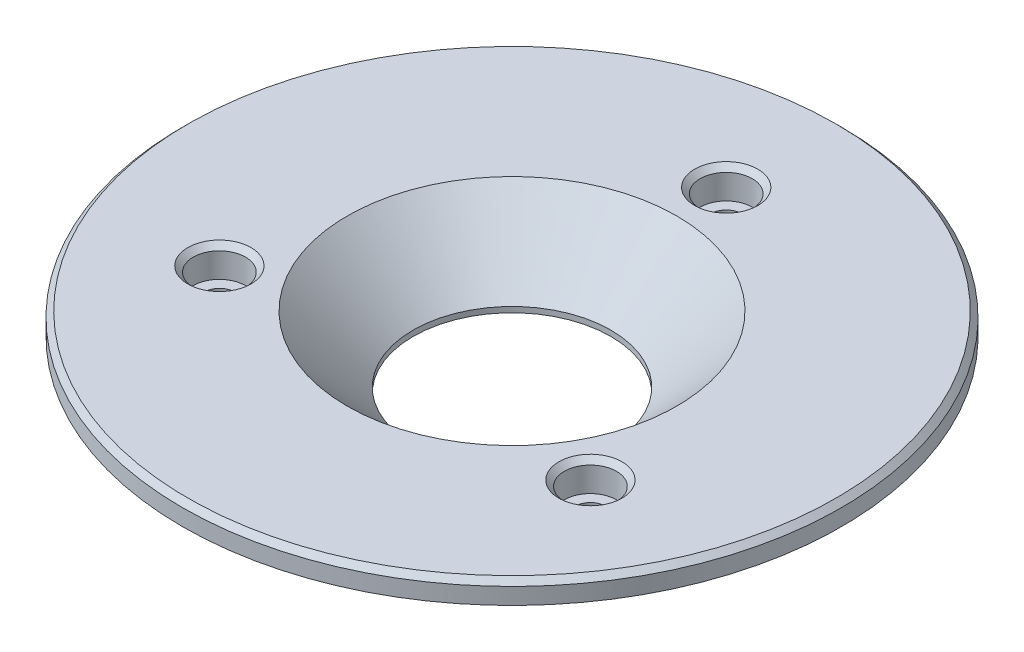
ISO-10303-21;
HEADER;
FILE_DESCRIPTION(('STEP AP214'),'2;1');
FILE_NAME('part.step','',(''),(''),'','','');
FILE_SCHEMA(('AUTOMOTIVE_DESIGN { 1 0 10303 214 1 1 1 1 }'));
ENDSEC;
DATA;
#1=APPLICATION_CONTEXT('core data for automotive mechanical design processes');
#2=APPLICATION_PROTOCOL_DEFINITION('international standard','automotive_design',2000,#1);
#3=PRODUCT_CONTEXT('',#1,'mechanical');
#4=PRODUCT('Part','Part','',(#3));
#5=PRODUCT_RELATED_PRODUCT_CATEGORY('part','',(#4));
#6=PRODUCT_DEFINITION_FORMATION('','',#4);
#7=PRODUCT_DEFINITION_CONTEXT('part definition',#1,'design');
#8=PRODUCT_DEFINITION('design','',#6,#7);
#9=PRODUCT_DEFINITION_SHAPE('','',#8);
#10=(LENGTH_UNIT() NAMED_UNIT(*) SI_UNIT(.MILLI.,.METRE.));
#11=(NAMED_UNIT(*) PLANE_ANGLE_UNIT() SI_UNIT($,.RADIAN.));
#12=(NAMED_UNIT(*) SI_UNIT($,.STERADIAN.) SOLID_ANGLE_UNIT());
#13=UNCERTAINTY_MEASURE_WITH_UNIT(LENGTH_MEASURE(1.E-05),#10,'distance_accuracy_value','');
#14=(GEOMETRIC_REPRESENTATION_CONTEXT(3) GLOBAL_UNCERTAINTY_ASSIGNED_CONTEXT((#13)) GLOBAL_UNIT_ASSIGNED_CONTEXT((#10,
#11,#12)) REPRESENTATION_CONTEXT('',''));
#15=CARTESIAN_POINT('',(0.,0.,0.));
#16=DIRECTION('',(0.,0.,1.));
#17=DIRECTION('',(1.,0.,0.));
#18=AXIS2_PLACEMENT_3D('',#15,#16,#17);
#19=CARTESIAN_POINT('',(-30.,13.,0.));
#20=DIRECTION('',(0.,-1.,0.));
#21=DIRECTION('',(0.,0.,-1.));
#22=AXIS2_PLACEMENT_3D('',#19,#20,#21);
#23=PLANE('',#22);
#24=CARTESIAN_POINT('',(33.7749907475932,13.,19.5));
#25=DIRECTION('',(0.,-1.,0.));
#26=DIRECTION('',(0.,0.,-1.));
#27=AXIS2_PLACEMENT_3D('',#24,#25,#26);
#28=CIRCLE('',#27,5.75);
#29=CARTESIAN_POINT('',(33.7749907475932,13.,13.75));
#30=VERTEX_POINT('',#29);
#31=EDGE_CURVE('E25',#30,#30,#28,.T.);
#32=ORIENTED_EDGE('',*,*,#31,.T.);
#33=EDGE_LOOP('',(#32));
#34=FACE_BOUND('',#33,.T.);
#35=CARTESIAN_POINT('',(0.,13.,-39.));
#36=DIRECTION('',(0.,-1.,0.));
#37=DIRECTION('',(0.,0.,-1.));
#38=AXIS2_PLACEMENT_3D('',#35,#36,#37);
#39=CIRCLE('',#38,5.75);
#40=CARTESIAN_POINT('',(0.,13.,-44.75));
#41=VERTEX_POINT('',#40);
#42=EDGE_CURVE('E29',#41,#41,#39,.T.);
#43=ORIENTED_EDGE('',*,*,#42,.T.);
#44=EDGE_LOOP('',(#43));
#45=FACE_BOUND('',#44,.T.);
#46=CARTESIAN_POINT('',(-33.7749907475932,13.,19.5));
#47=DIRECTION('',(0.,-1.,0.));
#48=DIRECTION('',(0.,0.,-1.));
#49=AXIS2_PLACEMENT_3D('',#46,#47,#48);
#50=CIRCLE('',#49,5.75);
#51=CARTESIAN_POINT('',(-33.7749907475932,13.,13.75));
#52=VERTEX_POINT('',#51);
#53=EDGE_CURVE('E34',#52,#52,#50,.T.);
#54=ORIENTED_EDGE('',*,*,#53,.T.);
#55=EDGE_LOOP('',(#54));
#56=FACE_BOUND('',#55,.T.);
#57=CARTESIAN_POINT('',(0.,13.,0.));
#58=DIRECTION('',(0.,-1.,0.));
#59=DIRECTION('',(0.,0.,-1.));
#60=AXIS2_PLACEMENT_3D('',#57,#58,#59);
#61=CIRCLE('',#60,59.);
#62=CARTESIAN_POINT('',(0.,13.,-59.));
#63=VERTEX_POINT('',#62);
#64=EDGE_CURVE('E58',#63,#63,#61,.F.);
#65=ORIENTED_EDGE('',*,*,#64,.T.);
#66=EDGE_LOOP('',(#65));
#67=FACE_BOUND('',#66,.T.);
#68=CARTESIAN_POINT('',(0.,13.,0.));
#69=DIRECTION('',(0.,-1.,0.));
#70=DIRECTION('',(0.,0.,-1.));
#71=AXIS2_PLACEMENT_3D('',#68,#69,#70);
#72=CIRCLE('',#71,30.);
#73=CARTESIAN_POINT('',(0.,13.,-30.));
#74=VERTEX_POINT('',#73);
#75=EDGE_CURVE('E70',#74,#74,#72,.T.);
#76=ORIENTED_EDGE('',*,*,#75,.T.);
#77=EDGE_LOOP('',(#76));
#78=FACE_BOUND('',#77,.T.);
#79=ADVANCED_FACE('F14',(#34,#45,#56,#67,#78),#23,.F.);
#80=CARTESIAN_POINT('',(0.,1.,0.));
#81=DIRECTION('',(0.,1.,0.));
#82=DIRECTION('',(0.,0.,1.));
#83=AXIS2_PLACEMENT_3D('',#80,#81,#82);
#84=CONICAL_SURFACE('',#83,18.,0.78539816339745);
#85=ORIENTED_EDGE('',*,*,#75,.F.);
#86=EDGE_LOOP('',(#85));
#87=FACE_BOUND('',#86,.T.);
#88=CARTESIAN_POINT('',(0.,1.,0.));
#89=DIRECTION('',(0.,-1.,0.));
#90=DIRECTION('',(0.,0.,-1.));
#91=AXIS2_PLACEMENT_3D('',#88,#89,#90);
#92=CIRCLE('',#91,18.);
#93=CARTESIAN_POINT('',(0.,1.,-18.));
#94=VERTEX_POINT('',#93);
#95=EDGE_CURVE('E83',#94,#94,#92,.T.);
#96=ORIENTED_EDGE('',*,*,#95,.T.);
#97=EDGE_LOOP('',(#96));
#98=FACE_BOUND('',#97,.T.);
#99=ADVANCED_FACE('F123',(#87,#98),#84,.F.);
#100=CARTESIAN_POINT('',(0.,0.,0.));
#101=DIRECTION('',(0.,-1.,0.));
#102=DIRECTION('',(0.,0.,-1.));
#103=AXIS2_PLACEMENT_3D('',#100,#101,#102);
#104=CYLINDRICAL_SURFACE('',#103,18.);
#105=ORIENTED_EDGE('',*,*,#95,.F.);
#106=EDGE_LOOP('',(#105));
#107=FACE_BOUND('',#106,.T.);
#108=CARTESIAN_POINT('',(0.,0.,0.));
#109=DIRECTION('',(0.,-1.,0.));
#110=DIRECTION('',(0.,0.,-1.));
#111=AXIS2_PLACEMENT_3D('',#108,#109,#110);
#112=CIRCLE('',#111,18.);
#113=CARTESIAN_POINT('',(0.,0.,-18.));
#114=VERTEX_POINT('',#113);
#115=EDGE_CURVE('E86',#114,#114,#112,.T.);
#116=ORIENTED_EDGE('',*,*,#115,.T.);
#117=EDGE_LOOP('',(#116));
#118=FACE_BOUND('',#117,.T.);
#119=ADVANCED_FACE('F130',(#107,#118),#104,.F.);
#120=CARTESIAN_POINT('',(-18.,0.,0.));
#121=DIRECTION('',(0.,1.,0.));
#122=DIRECTION('',(0.,0.,1.));
#123=AXIS2_PLACEMENT_3D('',#120,#121,#122);
#124=PLANE('',#123);
#125=CARTESIAN_POINT('',(-33.7749907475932,0.,19.5));
#126=DIRECTION('',(0.,1.,0.));
#127=DIRECTION('',(0.,0.,1.));
#128=AXIS2_PLACEMENT_3D('',#125,#126,#127);
#129=CIRCLE('',#128,3.75);
#130=CARTESIAN_POINT('',(-33.7749907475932,0.,23.25));
#131=VERTEX_POINT('',#130);
#132=EDGE_CURVE('E49',#131,#131,#129,.T.);
#133=ORIENTED_EDGE('',*,*,#132,.T.);
#134=EDGE_LOOP('',(#133));
#135=FACE_BOUND('',#134,.T.);
#136=CARTESIAN_POINT('',(33.7749907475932,0.,19.5));
#137=DIRECTION('',(0.,1.,0.));
#138=DIRECTION('',(0.,0.,1.));
#139=AXIS2_PLACEMENT_3D('',#136,#137,#138);
#140=CIRCLE('',#139,3.75);
#141=CARTESIAN_POINT('',(33.7749907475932,0.,23.25));
#142=VERTEX_POINT('',#141);
#143=EDGE_CURVE('E52',#142,#142,#140,.T.);
#144=ORIENTED_EDGE('',*,*,#143,.T.);
#145=EDGE_LOOP('',(#144));
#146=FACE_BOUND('',#145,.T.);
#147=CARTESIAN_POINT('',(0.,0.,-39.));
#148=DIRECTION('',(0.,1.,0.));
#149=DIRECTION('',(0.,0.,1.));
#150=AXIS2_PLACEMENT_3D('',#147,#148,#149);
#151=CIRCLE('',#150,3.75);
#152=CARTESIAN_POINT('',(0.,0.,-35.25));
#153=VERTEX_POINT('',#152);
#154=EDGE_CURVE('E55',#153,#153,#151,.T.);
#155=ORIENTED_EDGE('',*,*,#154,.T.);
#156=EDGE_LOOP('',(#155));
#157=FACE_BOUND('',#156,.T.);
#158=CARTESIAN_POINT('',(0.,0.,0.));
#159=DIRECTION('',(0.,1.,0.));
#160=DIRECTION('',(0.,0.,1.));
#161=AXIS2_PLACEMENT_3D('',#158,#159,#160);
#162=CIRCLE('',#161,44.);
#163=CARTESIAN_POINT('',(0.,0.,44.));
#164=VERTEX_POINT('',#163);
#165=EDGE_CURVE('E67',#164,#164,#162,.F.);
#166=ORIENTED_EDGE('',*,*,#165,.T.);
#167=EDGE_LOOP('',(#166));
#168=FACE_BOUND('',#167,.T.);
#169=ORIENTED_EDGE('',*,*,#115,.F.);
#170=EDGE_LOOP('',(#169));
#171=FACE_BOUND('',#170,.T.);
#172=ADVANCED_FACE('F181',(#135,#146,#157,#168,#171),#124,.F.);
#173=CARTESIAN_POINT('',(0.,0.,0.));
#174=DIRECTION('',(0.,-1.,0.));
#175=DIRECTION('',(0.,0.,-1.));
#176=AXIS2_PLACEMENT_3D('',#173,#174,#175);
#177=CYLINDRICAL_SURFACE('',#176,45.);
#178=CARTESIAN_POINT('',(0.,1.,0.));
#179=DIRECTION('',(0.,1.,0.));
#180=DIRECTION('',(0.,0.,1.));
#181=AXIS2_PLACEMENT_3D('',#178,#179,#180);
#182=CIRCLE('',#181,45.);
#183=CARTESIAN_POINT('',(0.,1.,45.));
#184=VERTEX_POINT('',#183);
#185=EDGE_CURVE('E64',#184,#184,#182,.T.);
#186=ORIENTED_EDGE('',*,*,#185,.T.);
#187=EDGE_LOOP('',(#186));
#188=FACE_BOUND('',#187,.T.);
#189=CARTESIAN_POINT('',(0.,9.,0.));
#190=DIRECTION('',(0.,-1.,0.));
#191=DIRECTION('',(0.,0.,-1.));
#192=AXIS2_PLACEMENT_3D('',#189,#190,#191);
#193=CIRCLE('',#192,45.);
#194=CARTESIAN_POINT('',(0.,9.,-45.));
#195=VERTEX_POINT('',#194);
#196=EDGE_CURVE('E89',#195,#195,#193,.T.);
#197=ORIENTED_EDGE('',*,*,#196,.T.);
#198=EDGE_LOOP('',(#197));
#199=FACE_BOUND('',#198,.T.);
#200=ADVANCED_FACE('F185',(#188,#199),#177,.T.);
#201=CARTESIAN_POINT('',(-45.,9.,0.));
#202=DIRECTION('',(0.,1.,0.));
#203=DIRECTION('',(0.,0.,1.));
#204=AXIS2_PLACEMENT_3D('',#201,#202,#203);
#205=PLANE('',#204);
#206=ORIENTED_EDGE('',*,*,#196,.F.);
#207=EDGE_LOOP('',(#206));
#208=FACE_BOUND('',#207,.T.);
#209=CARTESIAN_POINT('',(0.,9.,0.));
#210=DIRECTION('',(0.,-1.,0.));
#211=DIRECTION('',(0.,0.,-1.));
#212=AXIS2_PLACEMENT_3D('',#209,#210,#211);
#213=CIRCLE('',#212,60.);
#214=CARTESIAN_POINT('',(0.,9.,-60.));
#215=VERTEX_POINT('',#214);
#216=EDGE_CURVE('E92',#215,#215,#213,.T.);
#217=ORIENTED_EDGE('',*,*,#216,.T.);
#218=EDGE_LOOP('',(#217));
#219=FACE_BOUND('',#218,.T.);
#220=ADVANCED_FACE('F192',(#208,#219),#205,.F.);
#221=CARTESIAN_POINT('',(0.,0.,0.));
#222=DIRECTION('',(0.,-1.,0.));
#223=DIRECTION('',(0.,0.,-1.));
#224=AXIS2_PLACEMENT_3D('',#221,#222,#223);
#225=CYLINDRICAL_SURFACE('',#224,60.);
#226=CARTESIAN_POINT('',(0.,12.,0.));
#227=DIRECTION('',(0.,-1.,0.));
#228=DIRECTION('',(0.,0.,-1.));
#229=AXIS2_PLACEMENT_3D('',#226,#227,#228);
#230=CIRCLE('',#229,60.);
#231=CARTESIAN_POINT('',(0.,12.,-60.));
#232=VERTEX_POINT('',#231);
#233=EDGE_CURVE('E61',#232,#232,#230,.T.);
#234=ORIENTED_EDGE('',*,*,#233,.T.);
#235=EDGE_LOOP('',(#234));
#236=FACE_BOUND('',#235,.T.);
#237=ORIENTED_EDGE('',*,*,#216,.F.);
#238=EDGE_LOOP('',(#237));
#239=FACE_BOUND('',#238,.T.);
#240=ADVANCED_FACE('F199',(#236,#239),#225,.T.);
#241=CARTESIAN_POINT('',(33.7749907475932,7.5,19.5));
#242=DIRECTION('',(0.,1.,0.));
#243=DIRECTION('',(0.,0.,1.));
#244=AXIS2_PLACEMENT_3D('',#241,#242,#243);
#245=CYLINDRICAL_SURFACE('',#244,4.75);
#246=CARTESIAN_POINT('',(33.7749907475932,12.,19.5));
#247=DIRECTION('',(0.,-1.,0.));
#248=DIRECTION('',(0.,0.,-1.));
#249=AXIS2_PLACEMENT_3D('',#246,#247,#248);
#250=CIRCLE('',#249,4.75);
#251=CARTESIAN_POINT('',(33.7749907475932,12.,14.75));
#252=VERTEX_POINT('',#251);
#253=EDGE_CURVE('E37',#252,#252,#250,.F.);
#254=ORIENTED_EDGE('',*,*,#253,.T.);
#255=EDGE_LOOP('',(#254));
#256=FACE_BOUND('',#255,.T.);
#257=CARTESIAN_POINT('',(33.7749907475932,7.5,19.5));
#258=DIRECTION('',(0.,1.,0.));
#259=DIRECTION('',(0.,0.,-1.));
#260=AXIS2_PLACEMENT_3D('',#257,#258,#259);
#261=CIRCLE('',#260,4.75);
#262=CARTESIAN_POINT('',(33.7749907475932,7.5,14.75));
#263=VERTEX_POINT('',#262);
#264=EDGE_CURVE('E74',#263,#263,#261,.T.);
#265=ORIENTED_EDGE('',*,*,#264,.F.);
#266=EDGE_LOOP('',(#265));
#267=FACE_BOUND('',#266,.T.);
#268=ADVANCED_FACE('F203',(#256,#267),#245,.F.);
#269=CARTESIAN_POINT('',(33.7749907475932,7.5,19.5));
#270=DIRECTION('',(0.,-1.,0.));
#271=DIRECTION('',(0.,0.,-1.));
#272=AXIS2_PLACEMENT_3D('',#269,#270,#271);
#273=PLANE('',#272);
#274=CARTESIAN_POINT('',(33.7749907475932,7.5,19.5));
#275=DIRECTION('',(0.,-1.,0.));
#276=DIRECTION('',(0.,0.,-1.));
#277=AXIS2_PLACEMENT_3D('',#274,#275,#276);
#278=CIRCLE('',#277,2.75);
#279=CARTESIAN_POINT('',(33.7749907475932,7.5,16.75));
#280=VERTEX_POINT('',#279);
#281=EDGE_CURVE('E71',#280,#280,#278,.T.);
#282=ORIENTED_EDGE('',*,*,#281,.T.);
#283=EDGE_LOOP('',(#282));
#284=FACE_BOUND('',#283,.T.);
#285=ORIENTED_EDGE('',*,*,#264,.T.);
#286=EDGE_LOOP('',(#285));
#287=FACE_BOUND('',#286,.T.);
#288=ADVANCED_FACE('F207',(#284,#287),#273,.F.);
#289=CARTESIAN_POINT('',(-33.7749907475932,7.5,19.5));
#290=DIRECTION('',(0.,1.,0.));
#291=DIRECTION('',(0.,0.,1.));
#292=AXIS2_PLACEMENT_3D('',#289,#290,#291);
#293=CYLINDRICAL_SURFACE('',#292,4.75);
#294=CARTESIAN_POINT('',(-33.7749907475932,12.,19.5));
#295=DIRECTION('',(0.,-1.,0.));
#296=DIRECTION('',(0.,0.,-1.));
#297=AXIS2_PLACEMENT_3D('',#294,#295,#296);
#298=CIRCLE('',#297,4.75);
#299=CARTESIAN_POINT('',(-33.7749907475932,12.,14.75));
#300=VERTEX_POINT('',#299);
#301=EDGE_CURVE('E9',#300,#300,#298,.F.);
#302=ORIENTED_EDGE('',*,*,#301,.T.);
#303=EDGE_LOOP('',(#302));
#304=FACE_BOUND('',#303,.T.);
#305=CARTESIAN_POINT('',(-33.7749907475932,7.5,19.5));
#306=DIRECTION('',(0.,1.,0.));
#307=DIRECTION('',(0.,0.,1.));
#308=AXIS2_PLACEMENT_3D('',#305,#306,#307);
#309=CIRCLE('',#308,4.75);
#310=CARTESIAN_POINT('',(-33.7749907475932,7.5,24.25));
#311=VERTEX_POINT('',#310);
#312=EDGE_CURVE('E98',#311,#311,#309,.T.);
#313=ORIENTED_EDGE('',*,*,#312,.F.);
#314=EDGE_LOOP('',(#313));
#315=FACE_BOUND('',#314,.T.);
#316=ADVANCED_FACE('F119',(#304,#315),#293,.F.);
#317=CARTESIAN_POINT('',(-33.7749907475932,7.5,19.5));
#318=DIRECTION('',(0.,1.,0.));
#319=DIRECTION('',(0.,0.,1.));
#320=AXIS2_PLACEMENT_3D('',#317,#318,#319);
#321=PLANE('',#320);
#322=CARTESIAN_POINT('',(-33.7749907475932,7.5,19.5));
#323=DIRECTION('',(0.,1.,0.));
#324=DIRECTION('',(0.,0.,1.));
#325=AXIS2_PLACEMENT_3D('',#322,#323,#324);
#326=CIRCLE('',#325,2.75);
#327=CARTESIAN_POINT('',(-33.7749907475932,7.5,22.25));
#328=VERTEX_POINT('',#327);
#329=EDGE_CURVE('E75',#328,#328,#326,.T.);
#330=ORIENTED_EDGE('',*,*,#329,.F.);
#331=EDGE_LOOP('',(#330));
#332=FACE_BOUND('',#331,.T.);
#333=ORIENTED_EDGE('',*,*,#312,.T.);
#334=EDGE_LOOP('',(#333));
#335=FACE_BOUND('',#334,.T.);
#336=ADVANCED_FACE('F108',(#332,#335),#321,.T.);
#337=CARTESIAN_POINT('',(0.,7.5,-39.));
#338=DIRECTION('',(0.,1.,0.));
#339=DIRECTION('',(0.,0.,1.));
#340=AXIS2_PLACEMENT_3D('',#337,#338,#339);
#341=CYLINDRICAL_SURFACE('',#340,4.75);
#342=CARTESIAN_POINT('',(0.,12.,-39.));
#343=DIRECTION('',(0.,-1.,0.));
#344=DIRECTION('',(0.,0.,-1.));
#345=AXIS2_PLACEMENT_3D('',#342,#343,#344);
#346=CIRCLE('',#345,4.75);
#347=CARTESIAN_POINT('',(0.,12.,-43.75));
#348=VERTEX_POINT('',#347);
#349=EDGE_CURVE('E21',#348,#348,#346,.F.);
#350=ORIENTED_EDGE('',*,*,#349,.T.);
#351=EDGE_LOOP('',(#350));
#352=FACE_BOUND('',#351,.T.);
#353=CARTESIAN_POINT('',(0.,7.5,-39.));
#354=DIRECTION('',(0.,1.,0.));
#355=DIRECTION('',(0.,0.,1.));
#356=AXIS2_PLACEMENT_3D('',#353,#354,#355);
#357=CIRCLE('',#356,4.75);
#358=CARTESIAN_POINT('',(0.,7.5,-34.25));
#359=VERTEX_POINT('',#358);
#360=EDGE_CURVE('E95',#359,#359,#357,.T.);
#361=ORIENTED_EDGE('',*,*,#360,.F.);
#362=EDGE_LOOP('',(#361));
#363=FACE_BOUND('',#362,.T.);
#364=ADVANCED_FACE('F106',(#352,#363),#341,.F.);
#365=CARTESIAN_POINT('',(0.,7.5,-39.));
#366=DIRECTION('',(0.,1.,0.));
#367=DIRECTION('',(0.,0.,1.));
#368=AXIS2_PLACEMENT_3D('',#365,#366,#367);
#369=PLANE('',#368);
#370=CARTESIAN_POINT('',(0.,7.5,-39.));
#371=DIRECTION('',(0.,1.,0.));
#372=DIRECTION('',(0.,0.,1.));
#373=AXIS2_PLACEMENT_3D('',#370,#371,#372);
#374=CIRCLE('',#373,2.75);
#375=CARTESIAN_POINT('',(0.,7.5,-36.25));
#376=VERTEX_POINT('',#375);
#377=EDGE_CURVE('E78',#376,#376,#374,.T.);
#378=ORIENTED_EDGE('',*,*,#377,.F.);
#379=EDGE_LOOP('',(#378));
#380=FACE_BOUND('',#379,.T.);
#381=ORIENTED_EDGE('',*,*,#360,.T.);
#382=EDGE_LOOP('',(#381));
#383=FACE_BOUND('',#382,.T.);
#384=ADVANCED_FACE('F104',(#380,#383),#369,.T.);
#385=CARTESIAN_POINT('',(0.,0.,-39.));
#386=DIRECTION('',(0.,1.,0.));
#387=DIRECTION('',(0.,0.,1.));
#388=AXIS2_PLACEMENT_3D('',#385,#386,#387);
#389=CYLINDRICAL_SURFACE('',#388,2.75);
#390=CARTESIAN_POINT('',(0.,1.00000000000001,-39.));
#391=DIRECTION('',(0.,1.,0.));
#392=DIRECTION('',(0.,0.,1.));
#393=AXIS2_PLACEMENT_3D('',#390,#391,#392);
#394=CIRCLE('',#393,2.75);
#395=CARTESIAN_POINT('',(0.,1.00000000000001,-36.25));
#396=VERTEX_POINT('',#395);
#397=EDGE_CURVE('E40',#396,#396,#394,.F.);
#398=ORIENTED_EDGE('',*,*,#397,.T.);
#399=EDGE_LOOP('',(#398));
#400=FACE_BOUND('',#399,.T.);
#401=ORIENTED_EDGE('',*,*,#377,.T.);
#402=EDGE_LOOP('',(#401));
#403=FACE_BOUND('',#402,.T.);
#404=ADVANCED_FACE('F116',(#400,#403),#389,.F.);
#405=CARTESIAN_POINT('',(-33.7749907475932,0.,19.5));
#406=DIRECTION('',(0.,1.,0.));
#407=DIRECTION('',(0.,0.,1.));
#408=AXIS2_PLACEMENT_3D('',#405,#406,#407);
#409=CYLINDRICAL_SURFACE('',#408,2.75);
#410=CARTESIAN_POINT('',(-33.7749907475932,1.,19.5));
#411=DIRECTION('',(0.,1.,0.));
#412=DIRECTION('',(0.,0.,1.));
#413=AXIS2_PLACEMENT_3D('',#410,#411,#412);
#414=CIRCLE('',#413,2.75);
#415=CARTESIAN_POINT('',(-33.7749907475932,1.,22.25));
#416=VERTEX_POINT('',#415);
#417=EDGE_CURVE('E46',#416,#416,#414,.F.);
#418=ORIENTED_EDGE('',*,*,#417,.T.);
#419=EDGE_LOOP('',(#418));
#420=FACE_BOUND('',#419,.T.);
#421=ORIENTED_EDGE('',*,*,#329,.T.);
#422=EDGE_LOOP('',(#421));
#423=FACE_BOUND('',#422,.T.);
#424=ADVANCED_FACE('F338',(#420,#423),#409,.F.);
#425=CARTESIAN_POINT('',(33.7749907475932,0.,19.5));
#426=DIRECTION('',(0.,1.,0.));
#427=DIRECTION('',(0.,0.,1.));
#428=AXIS2_PLACEMENT_3D('',#425,#426,#427);
#429=CYLINDRICAL_SURFACE('',#428,2.75);
#430=CARTESIAN_POINT('',(33.7749907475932,1.,19.5));
#431=DIRECTION('',(0.,1.,0.));
#432=DIRECTION('',(0.,0.,1.));
#433=AXIS2_PLACEMENT_3D('',#430,#431,#432);
#434=CIRCLE('',#433,2.75);
#435=CARTESIAN_POINT('',(33.7749907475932,1.,22.25));
#436=VERTEX_POINT('',#435);
#437=EDGE_CURVE('E43',#436,#436,#434,.F.);
#438=ORIENTED_EDGE('',*,*,#437,.T.);
#439=EDGE_LOOP('',(#438));
#440=FACE_BOUND('',#439,.T.);
#441=ORIENTED_EDGE('',*,*,#281,.F.);
#442=EDGE_LOOP('',(#441));
#443=FACE_BOUND('',#442,.T.);
#444=ADVANCED_FACE('F140',(#440,#443),#429,.F.);
#445=CARTESIAN_POINT('',(0.,0.,0.));
#446=DIRECTION('',(0.,1.,0.));
#447=DIRECTION('',(0.,0.,1.));
#448=AXIS2_PLACEMENT_3D('',#445,#446,#447);
#449=CONICAL_SURFACE('',#448,44.,0.785398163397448);
#450=ORIENTED_EDGE('',*,*,#185,.F.);
#451=EDGE_LOOP('',(#450));
#452=FACE_BOUND('',#451,.T.);
#453=ORIENTED_EDGE('',*,*,#165,.F.);
#454=EDGE_LOOP('',(#453));
#455=FACE_BOUND('',#454,.T.);
#456=ADVANCED_FACE('F136',(#452,#455),#449,.T.);
#457=CARTESIAN_POINT('',(0.,12.,0.));
#458=DIRECTION('',(0.,-1.,0.));
#459=DIRECTION('',(0.,0.,-1.));
#460=AXIS2_PLACEMENT_3D('',#457,#458,#459);
#461=CONICAL_SURFACE('',#460,60.,0.785398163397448);
#462=ORIENTED_EDGE('',*,*,#64,.F.);
#463=EDGE_LOOP('',(#462));
#464=FACE_BOUND('',#463,.T.);
#465=ORIENTED_EDGE('',*,*,#233,.F.);
#466=EDGE_LOOP('',(#465));
#467=FACE_BOUND('',#466,.T.);
#468=ADVANCED_FACE('F139',(#464,#467),#461,.T.);
#469=CARTESIAN_POINT('',(-33.7749907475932,0.,19.5));
#470=DIRECTION('',(0.,-1.,0.));
#471=DIRECTION('',(0.,0.,-1.));
#472=AXIS2_PLACEMENT_3D('',#469,#470,#471);
#473=CONICAL_SURFACE('',#472,3.75,0.785398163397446);
#474=ORIENTED_EDGE('',*,*,#417,.F.);
#475=EDGE_LOOP('',(#474));
#476=FACE_BOUND('',#475,.T.);
#477=ORIENTED_EDGE('',*,*,#132,.F.);
#478=EDGE_LOOP('',(#477));
#479=FACE_BOUND('',#478,.T.);
#480=ADVANCED_FACE('F144',(#476,#479),#473,.F.);
#481=CARTESIAN_POINT('',(33.7749907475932,0.,19.5));
#482=DIRECTION('',(0.,-1.,0.));
#483=DIRECTION('',(0.,0.,-1.));
#484=AXIS2_PLACEMENT_3D('',#481,#482,#483);
#485=CONICAL_SURFACE('',#484,3.75,0.785398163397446);
#486=ORIENTED_EDGE('',*,*,#437,.F.);
#487=EDGE_LOOP('',(#486));
#488=FACE_BOUND('',#487,.T.);
#489=ORIENTED_EDGE('',*,*,#143,.F.);
#490=EDGE_LOOP('',(#489));
#491=FACE_BOUND('',#490,.T.);
#492=ADVANCED_FACE('F148',(#488,#491),#485,.F.);
#493=CARTESIAN_POINT('',(0.,0.,-39.));
#494=DIRECTION('',(0.,-1.,0.));
#495=DIRECTION('',(0.,0.,-1.));
#496=AXIS2_PLACEMENT_3D('',#493,#494,#495);
#497=CONICAL_SURFACE('',#496,3.75,0.785398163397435);
#498=ORIENTED_EDGE('',*,*,#397,.F.);
#499=EDGE_LOOP('',(#498));
#500=FACE_BOUND('',#499,.T.);
#501=ORIENTED_EDGE('',*,*,#154,.F.);
#502=EDGE_LOOP('',(#501));
#503=FACE_BOUND('',#502,.T.);
#504=ADVANCED_FACE('F152',(#500,#503),#497,.F.);
#505=CARTESIAN_POINT('',(33.7749907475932,12.,19.5));
#506=DIRECTION('',(0.,1.,0.));
#507=DIRECTION('',(0.,0.,1.));
#508=AXIS2_PLACEMENT_3D('',#505,#506,#507);
#509=CONICAL_SURFACE('',#508,4.75,0.785398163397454);
#510=ORIENTED_EDGE('',*,*,#31,.F.);
#511=EDGE_LOOP('',(#510));
#512=FACE_BOUND('',#511,.T.);
#513=ORIENTED_EDGE('',*,*,#253,.F.);
#514=EDGE_LOOP('',(#513));
#515=FACE_BOUND('',#514,.T.);
#516=ADVANCED_FACE('F156',(#512,#515),#509,.F.);
#517=CARTESIAN_POINT('',(0.,12.,-39.));
#518=DIRECTION('',(0.,1.,0.));
#519=DIRECTION('',(0.,0.,1.));
#520=AXIS2_PLACEMENT_3D('',#517,#518,#519);
#521=CONICAL_SURFACE('',#520,4.75,0.785398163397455);
#522=ORIENTED_EDGE('',*,*,#42,.F.);
#523=EDGE_LOOP('',(#522));
#524=FACE_BOUND('',#523,.T.);
#525=ORIENTED_EDGE('',*,*,#349,.F.);
#526=EDGE_LOOP('',(#525));
#527=FACE_BOUND('',#526,.T.);
#528=ADVANCED_FACE('F159',(#524,#527),#521,.F.);
#529=CARTESIAN_POINT('',(-33.7749907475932,12.,19.5));
#530=DIRECTION('',(0.,1.,0.));
#531=DIRECTION('',(0.,0.,1.));
#532=AXIS2_PLACEMENT_3D('',#529,#530,#531);
#533=CONICAL_SURFACE('',#532,4.75,0.785398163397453);
#534=ORIENTED_EDGE('',*,*,#53,.F.);
#535=EDGE_LOOP('',(#534));
#536=FACE_BOUND('',#535,.T.);
#537=ORIENTED_EDGE('',*,*,#301,.F.);
#538=EDGE_LOOP('',(#537));
#539=FACE_BOUND('',#538,.T.);
#540=ADVANCED_FACE('F16',(#536,#539),#533,.F.);
#541=CLOSED_SHELL('',(#79,#99,#119,#172,#200,#220,#240,#268,#288,#316,#336,#364,#384,#404,#424,
#444,#456,#468,#480,#492,#504,#516,#528,#540));
#542=MANIFOLD_SOLID_BREP('B1',#541);
#543=ADVANCED_BREP_SHAPE_REPRESENTATION('',(#18,#542),#14);
#544=SHAPE_DEFINITION_REPRESENTATION(#9,#543);
ENDSEC;
END-ISO-10303-21;
